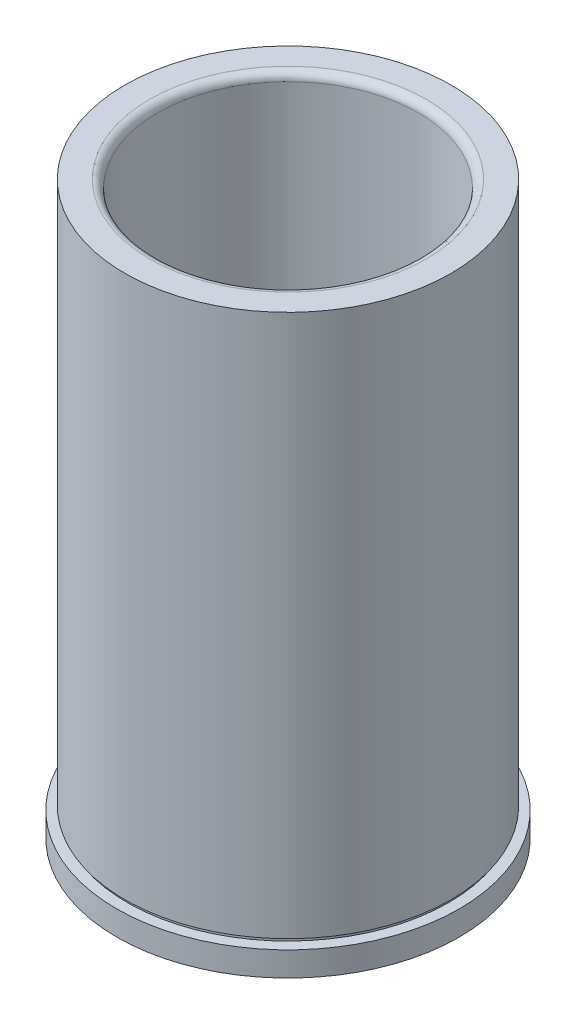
from build123d import *

# Parameters (mm, degrees)
FILLET1_R = 1.524


with BuildPart() as part:
    # Sketch1 → Revolve1 (revolve)
    with BuildSketch(Plane.XY, mode=Mode.PRIVATE) as revolve1_sk:
        with BuildLine():
            Line((-25.40635, 111.125), (-25.40635, 9.525))
            ThreePointArc((-25.40635, 9.525), (-26.304375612, 9.153025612), (-26.67635, 8.255))
            Line((-26.67635, 8.255), (-26.67635, 0.79375))
            Line((-26.67635, 0.79375), (-27.4701, 0))
            Line((-27.4701, 0), (-33.3375, 0))
            Line((-33.3375, 0), (-33.3375, 4.7625))
            Line((-33.3375, 4.7625), (-31.24835, 4.7625))
            Line((-31.24835, 4.7625), (-31.24835, 5.5245))
            Line((-31.24835, 5.5245), (-31.75635, 5.5245))
            Line((-31.75635, 5.5245), (-31.75635, 111.125))
            Line((-31.75635, 111.125), (-25.40635, 111.125))
        make_face()
    revolve(revolve1_sk.sketch.rotate(Axis((0, -1000, 0), (0, 1, 0)), 180), axis=Axis((0, -1000, 0), (0, 1, 0)))

    # Fillet1
    fillet1_edges = [part.edges().sort_by_distance(p)[0] for p in [
        (-25.40635, 111.125, 0),
    ]]
    fillet(fillet1_edges, radius=FILLET1_R)


solid = part.part
